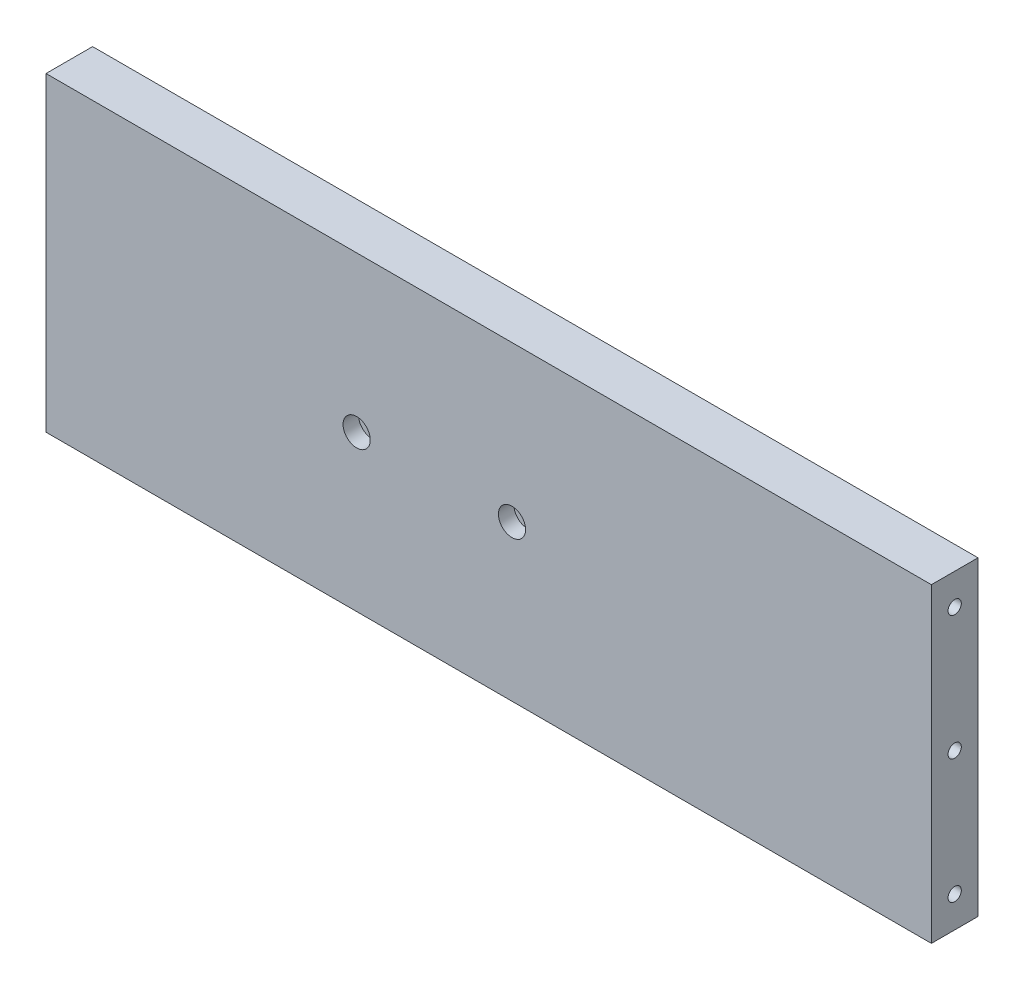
from build123d import *

# Parameters (mm, degrees)
SKETCH1_W                                        = 361.95
SKETCH1_H                                        = 127
BOSS_EXTRUDE1_DEPTH                              = 19.05
F_1_4_28_TAPPED_HOLE1_AT_2_COUNT                 = 2
F_1_4_28_TAPPED_HOLE1_AT_2_PITCH                 = 50.8
F_1_4_28_TAPPED_HOLE1_AT_3_COUNT                 = 2
F_1_4_28_TAPPED_HOLE1_AT_3_PITCH                 = 101.6
CBORE_FOR_1_4_SOCKET_HEAD_CAP_SCREW1_D           = 6.5278
CBORE_FOR_1_4_SOCKET_HEAD_CAP_SCREW1_CBORE_D     = 11.1125
CBORE_FOR_1_4_SOCKET_HEAD_CAP_SCREW1_CBORE_DEPTH = 6.35


with BuildPart() as part:
    # Sketch1 → Boss-Extrude1 (new body)
    with BuildSketch(Plane.XY):
        Rectangle(SKETCH1_W, SKETCH1_H)
    extrude(amount=BOSS_EXTRUDE1_DEPTH)

    # Sketch2 → 1_4-28 Tapped Hole1 (revolve, cut)
    with BuildSketch(Plane(origin=(180.975, 50.8, 9.525), x_dir=(0, 0, -1), z_dir=(0, 1, 0))):
        Polygon((0, 0), (0, 17.043188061), (2.7051, 15.4178), (2.7051, 0), align=None)
    f_1_4_28_tapped_hole1 = revolve(axis=Axis((187.325, 50.8, 9.525), (-1, 0, 0)), mode=Mode.SUBTRACT)

    # 1_4-28 Tapped Hole1 at 2: 1_4-28 Tapped Hole1 ×2
    with Locations(*[(0, -i * F_1_4_28_TAPPED_HOLE1_AT_2_PITCH, 0) for i in range(1, F_1_4_28_TAPPED_HOLE1_AT_2_COUNT)]):
        add(f_1_4_28_tapped_hole1, mode=Mode.SUBTRACT)

    # 1_4-28 Tapped Hole1 at 3: 1_4-28 Tapped Hole1 ×2
    with Locations(*[(0, -i * F_1_4_28_TAPPED_HOLE1_AT_3_PITCH, 0) for i in range(1, F_1_4_28_TAPPED_HOLE1_AT_3_COUNT)]):
        add(f_1_4_28_tapped_hole1, mode=Mode.SUBTRACT)

    # Mirror1: 1_4-28 Tapped Hole1 across plane
    add(f_1_4_28_tapped_hole1.mirror(Plane(origin=(0, 0, 0), x_dir=(0, 0, 1), z_dir=(1, 0, 0))), mode=Mode.SUBTRACT)

    # Mirror1 copy 1 sketch → Mirror1 copy 1 (revolve, cut)
    with BuildSketch(Plane(origin=(-180.975, 0, 9.525), x_dir=(0, 0, -1), z_dir=(0, 1, 0))):
        Polygon((0, 0), (0, -17.043188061), (2.7051, -15.4178), (2.7051, 0), align=None)
    revolve(axis=Axis((-187.325, 0, 9.525), (-1, 0, 0)), mode=Mode.SUBTRACT)

    # Mirror1 copy 2 sketch → Mirror1 copy 2 (revolve, cut)
    with BuildSketch(Plane(origin=(-180.975, -50.8, 9.525), x_dir=(0, 0, -1), z_dir=(0, 1, 0))):
        Polygon((0, 0), (0, -17.043188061), (2.7051, -15.4178), (2.7051, 0), align=None)
    revolve(axis=Axis((-187.325, -50.8, 9.525), (-1, 0, 0)), mode=Mode.SUBTRACT)

    # CBORE for 1_4 Socket Head Cap Screw1 (through all)
    with Locations(Plane.XY.offset(19.05)):
        with Locations((-53.975, 0), (9.525, 0)):
            CounterBoreHole(CBORE_FOR_1_4_SOCKET_HEAD_CAP_SCREW1_D / 2, CBORE_FOR_1_4_SOCKET_HEAD_CAP_SCREW1_CBORE_D / 2, CBORE_FOR_1_4_SOCKET_HEAD_CAP_SCREW1_CBORE_DEPTH)


solid = part.part
